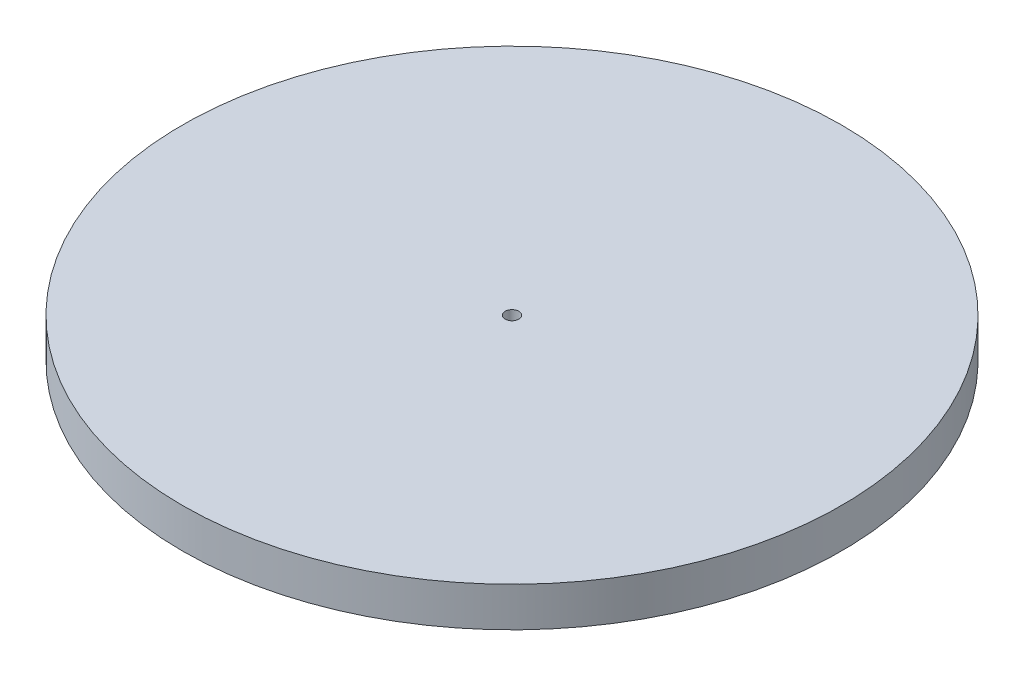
from build123d import *

# Parameters (mm, degrees)
SKETCH1_R           = 152.4
SKETCH1_R_2         = 3.175
BOSS_EXTRUDE1_DEPTH = 18.25625


with BuildPart() as part:
    # Sketch1 → Boss-Extrude1 (new body)
    with BuildSketch(Plane(origin=(0, 0, 0), x_dir=(1, 0, 0), z_dir=(0, 1, 0))):
        with Locations(Location((0, 0, 0), (0, 0, 270))):
            Circle(SKETCH1_R)
        with Locations(Location((0, 0, 0), (0, 0, 270))):
            Circle(SKETCH1_R_2, mode=Mode.SUBTRACT)
    extrude(amount=BOSS_EXTRUDE1_DEPTH)


solid = part.part
